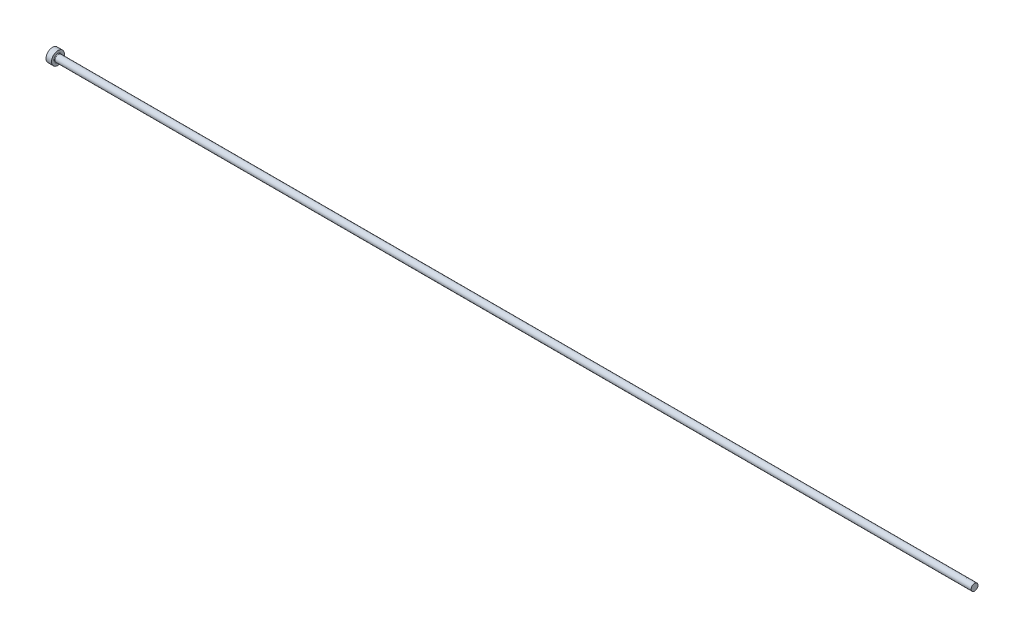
ISO-10303-21;
HEADER;
FILE_DESCRIPTION(('STEP AP214'),'2;1');
FILE_NAME('part.step','',(''),(''),'','','');
FILE_SCHEMA(('AUTOMOTIVE_DESIGN { 1 0 10303 214 1 1 1 1 }'));
ENDSEC;
DATA;
#1=APPLICATION_CONTEXT('core data for automotive mechanical design processes');
#2=APPLICATION_PROTOCOL_DEFINITION('international standard','automotive_design',2000,#1);
#3=PRODUCT_CONTEXT('',#1,'mechanical');
#4=PRODUCT('Part','Part','',(#3));
#5=PRODUCT_RELATED_PRODUCT_CATEGORY('part','',(#4));
#6=PRODUCT_DEFINITION_FORMATION('','',#4);
#7=PRODUCT_DEFINITION_CONTEXT('part definition',#1,'design');
#8=PRODUCT_DEFINITION('design','',#6,#7);
#9=PRODUCT_DEFINITION_SHAPE('','',#8);
#10=(LENGTH_UNIT() NAMED_UNIT(*) SI_UNIT(.MILLI.,.METRE.));
#11=(NAMED_UNIT(*) PLANE_ANGLE_UNIT() SI_UNIT($,.RADIAN.));
#12=(NAMED_UNIT(*) SI_UNIT($,.STERADIAN.) SOLID_ANGLE_UNIT());
#13=UNCERTAINTY_MEASURE_WITH_UNIT(LENGTH_MEASURE(1.E-05),#10,'distance_accuracy_value','');
#14=(GEOMETRIC_REPRESENTATION_CONTEXT(3) GLOBAL_UNCERTAINTY_ASSIGNED_CONTEXT((#13)) GLOBAL_UNIT_ASSIGNED_CONTEXT((#10,
#11,#12)) REPRESENTATION_CONTEXT('',''));
#15=CARTESIAN_POINT('',(0.,0.,0.));
#16=DIRECTION('',(0.,0.,1.));
#17=DIRECTION('',(1.,0.,0.));
#18=AXIS2_PLACEMENT_3D('',#15,#16,#17);
#19=CARTESIAN_POINT('',(0.,0.,0.));
#20=DIRECTION('',(-1.,0.,0.));
#21=DIRECTION('',(0.,-1.,0.));
#22=AXIS2_PLACEMENT_3D('',#19,#20,#21);
#23=PLANE('',#22);
#24=CARTESIAN_POINT('',(0.,0.,0.));
#25=DIRECTION('',(1.,0.,0.));
#26=DIRECTION('',(0.,1.,0.));
#27=AXIS2_PLACEMENT_3D('',#24,#25,#26);
#28=CIRCLE('',#27,3.5);
#29=CARTESIAN_POINT('',(0.,3.5,0.));
#30=VERTEX_POINT('',#29);
#31=EDGE_CURVE('E25',#30,#30,#28,.T.);
#32=ORIENTED_EDGE('',*,*,#31,.F.);
#33=EDGE_LOOP('',(#32));
#34=FACE_BOUND('',#33,.T.);
#35=ADVANCED_FACE('F14',(#34),#23,.T.);
#36=CARTESIAN_POINT('',(500.,0.,0.));
#37=DIRECTION('',(1.,0.,0.));
#38=DIRECTION('',(0.,1.,0.));
#39=AXIS2_PLACEMENT_3D('',#36,#37,#38);
#40=CYLINDRICAL_SURFACE('',#39,3.5);
#41=ORIENTED_EDGE('',*,*,#31,.T.);
#42=EDGE_LOOP('',(#41));
#43=FACE_BOUND('',#42,.T.);
#44=CARTESIAN_POINT('',(3.,0.,0.));
#45=DIRECTION('',(1.,0.,0.));
#46=DIRECTION('',(0.,1.,0.));
#47=AXIS2_PLACEMENT_3D('',#44,#45,#46);
#48=CIRCLE('',#47,3.5);
#49=CARTESIAN_POINT('',(3.,3.5,0.));
#50=VERTEX_POINT('',#49);
#51=EDGE_CURVE('E29',#50,#50,#48,.T.);
#52=ORIENTED_EDGE('',*,*,#51,.F.);
#53=EDGE_LOOP('',(#52));
#54=FACE_BOUND('',#53,.T.);
#55=ADVANCED_FACE('F51',(#43,#54),#40,.T.);
#56=CARTESIAN_POINT('',(3.,3.5,0.));
#57=DIRECTION('',(1.,0.,0.));
#58=DIRECTION('',(0.,1.,0.));
#59=AXIS2_PLACEMENT_3D('',#56,#57,#58);
#60=PLANE('',#59);
#61=CARTESIAN_POINT('',(3.,0.,0.));
#62=DIRECTION('',(1.,0.,0.));
#63=DIRECTION('',(0.,1.,0.));
#64=AXIS2_PLACEMENT_3D('',#61,#62,#63);
#65=CIRCLE('',#64,2.14999999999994);
#66=CARTESIAN_POINT('',(3.,2.14999999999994,0.));
#67=VERTEX_POINT('',#66);
#68=EDGE_CURVE('E9',#67,#67,#65,.F.);
#69=ORIENTED_EDGE('',*,*,#68,.T.);
#70=EDGE_LOOP('',(#69));
#71=FACE_BOUND('',#70,.T.);
#72=ORIENTED_EDGE('',*,*,#51,.T.);
#73=EDGE_LOOP('',(#72));
#74=FACE_BOUND('',#73,.T.);
#75=ADVANCED_FACE('F42',(#71,#74),#60,.T.);
#76=CARTESIAN_POINT('',(500.,0.,0.));
#77=DIRECTION('',(1.,0.,0.));
#78=DIRECTION('',(0.,1.,0.));
#79=AXIS2_PLACEMENT_3D('',#76,#77,#78);
#80=CYLINDRICAL_SURFACE('',#79,1.84999999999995);
#81=CARTESIAN_POINT('',(3.3,0.,0.));
#82=DIRECTION('',(1.,0.,0.));
#83=DIRECTION('',(0.,1.,0.));
#84=AXIS2_PLACEMENT_3D('',#81,#82,#83);
#85=CIRCLE('',#84,1.84999999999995);
#86=CARTESIAN_POINT('',(3.3,1.84999999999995,0.));
#87=VERTEX_POINT('',#86);
#88=EDGE_CURVE('E21',#87,#87,#85,.T.);
#89=ORIENTED_EDGE('',*,*,#88,.T.);
#90=EDGE_LOOP('',(#89));
#91=FACE_BOUND('',#90,.T.);
#92=CARTESIAN_POINT('',(500.,0.,0.));
#93=DIRECTION('',(1.,0.,0.));
#94=DIRECTION('',(0.,1.,0.));
#95=AXIS2_PLACEMENT_3D('',#92,#93,#94);
#96=CIRCLE('',#95,1.84999999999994);
#97=CARTESIAN_POINT('',(500.,1.84999999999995,0.));
#98=VERTEX_POINT('',#97);
#99=EDGE_CURVE('E34',#98,#98,#96,.T.);
#100=ORIENTED_EDGE('',*,*,#99,.F.);
#101=EDGE_LOOP('',(#100));
#102=FACE_BOUND('',#101,.T.);
#103=ADVANCED_FACE('F40',(#91,#102),#80,.T.);
#104=CARTESIAN_POINT('',(500.,1.84999999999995,0.));
#105=DIRECTION('',(1.,0.,0.));
#106=DIRECTION('',(0.,1.,0.));
#107=AXIS2_PLACEMENT_3D('',#104,#105,#106);
#108=PLANE('',#107);
#109=ORIENTED_EDGE('',*,*,#99,.T.);
#110=EDGE_LOOP('',(#109));
#111=FACE_BOUND('',#110,.T.);
#112=ADVANCED_FACE('F38',(#111),#108,.T.);
#113=CARTESIAN_POINT('',(3.3,0.,0.));
#114=DIRECTION('',(1.,0.,0.));
#115=DIRECTION('',(0.,1.,0.));
#116=AXIS2_PLACEMENT_3D('',#113,#114,#115);
#117=TOROIDAL_SURFACE('',#116,2.14999999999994,0.3);
#118=ORIENTED_EDGE('',*,*,#68,.F.);
#119=EDGE_LOOP('',(#118));
#120=FACE_BOUND('',#119,.T.);
#121=ORIENTED_EDGE('',*,*,#88,.F.);
#122=EDGE_LOOP('',(#121));
#123=FACE_BOUND('',#122,.T.);
#124=ADVANCED_FACE('F16',(#120,#123),#117,.F.);
#125=CLOSED_SHELL('',(#35,#55,#75,#103,#112,#124));
#126=MANIFOLD_SOLID_BREP('B1',#125);
#127=ADVANCED_BREP_SHAPE_REPRESENTATION('',(#18,#126),#14);
#128=SHAPE_DEFINITION_REPRESENTATION(#9,#127);
ENDSEC;
END-ISO-10303-21;
